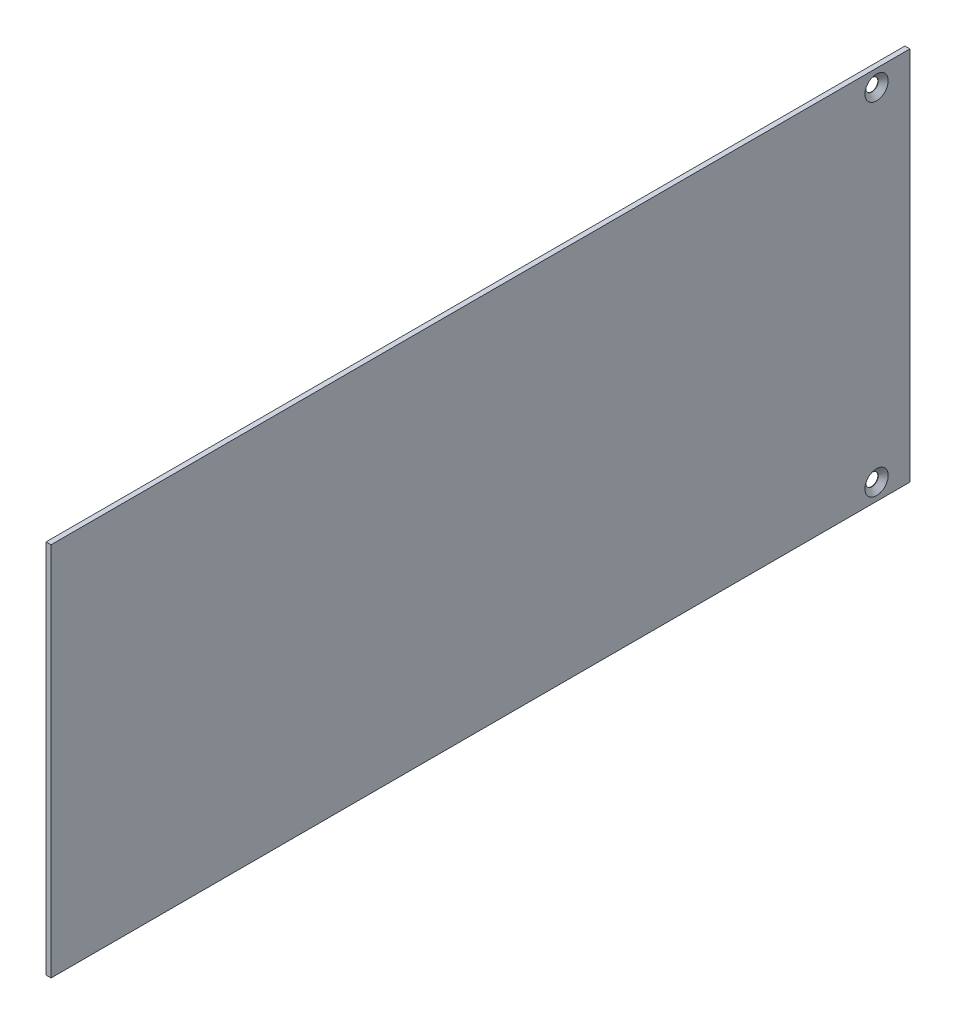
ISO-10303-21;
HEADER;
FILE_DESCRIPTION(('STEP AP214'),'2;1');
FILE_NAME('part.step','',(''),(''),'','','');
FILE_SCHEMA(('AUTOMOTIVE_DESIGN { 1 0 10303 214 1 1 1 1 }'));
ENDSEC;
DATA;
#1=APPLICATION_CONTEXT('core data for automotive mechanical design processes');
#2=APPLICATION_PROTOCOL_DEFINITION('international standard','automotive_design',2000,#1);
#3=PRODUCT_CONTEXT('',#1,'mechanical');
#4=PRODUCT('Part','Part','',(#3));
#5=PRODUCT_RELATED_PRODUCT_CATEGORY('part','',(#4));
#6=PRODUCT_DEFINITION_FORMATION('','',#4);
#7=PRODUCT_DEFINITION_CONTEXT('part definition',#1,'design');
#8=PRODUCT_DEFINITION('design','',#6,#7);
#9=PRODUCT_DEFINITION_SHAPE('','',#8);
#10=(LENGTH_UNIT() NAMED_UNIT(*) SI_UNIT(.MILLI.,.METRE.));
#11=(NAMED_UNIT(*) PLANE_ANGLE_UNIT() SI_UNIT($,.RADIAN.));
#12=(NAMED_UNIT(*) SI_UNIT($,.STERADIAN.) SOLID_ANGLE_UNIT());
#13=UNCERTAINTY_MEASURE_WITH_UNIT(LENGTH_MEASURE(1.E-05),#10,'distance_accuracy_value','');
#14=(GEOMETRIC_REPRESENTATION_CONTEXT(3) GLOBAL_UNCERTAINTY_ASSIGNED_CONTEXT((#13)) GLOBAL_UNIT_ASSIGNED_CONTEXT((#10,
#11,#12)) REPRESENTATION_CONTEXT('',''));
#15=CARTESIAN_POINT('',(0.,0.,0.));
#16=DIRECTION('',(0.,0.,1.));
#17=DIRECTION('',(1.,0.,0.));
#18=AXIS2_PLACEMENT_3D('',#15,#16,#17);
#19=CARTESIAN_POINT('',(-1.524,57.15,130.81));
#20=DIRECTION('',(1.,0.,0.));
#21=DIRECTION('',(0.,1.,0.));
#22=AXIS2_PLACEMENT_3D('',#19,#20,#21);
#23=PLANE('',#22);
#24=CARTESIAN_POINT('',(-1.524,52.07,-120.65));
#25=DIRECTION('',(1.,0.,0.));
#26=DIRECTION('',(0.,0.,-1.));
#27=AXIS2_PLACEMENT_3D('',#24,#25,#26);
#28=CIRCLE('',#27,1.89865);
#29=CARTESIAN_POINT('',(-1.524,52.07,-122.54865));
#30=VERTEX_POINT('',#29);
#31=EDGE_CURVE('E117',#30,#30,#28,.T.);
#32=ORIENTED_EDGE('',*,*,#31,.T.);
#33=EDGE_LOOP('',(#32));
#34=FACE_BOUND('',#33,.T.);
#35=CARTESIAN_POINT('',(-1.524,-52.07,-120.65));
#36=DIRECTION('',(1.,0.,0.));
#37=DIRECTION('',(0.,0.,-1.));
#38=AXIS2_PLACEMENT_3D('',#35,#36,#37);
#39=CIRCLE('',#38,1.89865);
#40=CARTESIAN_POINT('',(-1.524,-52.07,-122.54865));
#41=VERTEX_POINT('',#40);
#42=EDGE_CURVE('E98',#41,#41,#39,.T.);
#43=ORIENTED_EDGE('',*,*,#42,.T.);
#44=EDGE_LOOP('',(#43));
#45=FACE_BOUND('',#44,.T.);
#46=DIRECTION('',(0.,-1.,0.));
#47=VECTOR('',#46,1.);
#48=CARTESIAN_POINT('',(-1.524,57.15,-130.81));
#49=LINE('',#48,#47);
#50=CARTESIAN_POINT('',(-1.524,57.15,-130.81));
#51=VERTEX_POINT('',#50);
#52=CARTESIAN_POINT('',(-1.524,-57.15,-130.81));
#53=VERTEX_POINT('',#52);
#54=EDGE_CURVE('E95',#51,#53,#49,.T.);
#55=ORIENTED_EDGE('',*,*,#54,.T.);
#56=DIRECTION('',(0.,0.,-1.));
#57=VECTOR('',#56,1.);
#58=CARTESIAN_POINT('',(-1.524,-57.15,130.81));
#59=LINE('',#58,#57);
#60=CARTESIAN_POINT('',(-1.524,-57.15,130.81));
#61=VERTEX_POINT('',#60);
#62=EDGE_CURVE('E11',#61,#53,#59,.T.);
#63=ORIENTED_EDGE('',*,*,#62,.F.);
#64=DIRECTION('',(0.,-1.,0.));
#65=VECTOR('',#64,1.);
#66=CARTESIAN_POINT('',(-1.524,57.15,130.81));
#67=LINE('',#66,#65);
#68=CARTESIAN_POINT('',(-1.524,57.15,130.81));
#69=VERTEX_POINT('',#68);
#70=EDGE_CURVE('E83',#69,#61,#67,.T.);
#71=ORIENTED_EDGE('',*,*,#70,.F.);
#72=DIRECTION('',(0.,0.,-1.));
#73=VECTOR('',#72,1.);
#74=CARTESIAN_POINT('',(-1.524,57.15,130.81));
#75=LINE('',#74,#73);
#76=EDGE_CURVE('E91',#69,#51,#75,.T.);
#77=ORIENTED_EDGE('',*,*,#76,.T.);
#78=EDGE_LOOP('',(#55,#63,#71,#77));
#79=FACE_BOUND('',#78,.T.);
#80=ADVANCED_FACE('F32',(#34,#45,#79),#23,.F.);
#81=CARTESIAN_POINT('',(-1.524,-57.15,130.81));
#82=DIRECTION('',(0.,1.,0.));
#83=DIRECTION('',(-1.,0.,0.));
#84=AXIS2_PLACEMENT_3D('',#81,#82,#83);
#85=PLANE('',#84);
#86=DIRECTION('',(1.,0.,0.));
#87=VECTOR('',#86,1.);
#88=CARTESIAN_POINT('',(-1.524,-57.15,-130.81));
#89=LINE('',#88,#87);
#90=CARTESIAN_POINT('',(0.,-57.15,-130.81));
#91=VERTEX_POINT('',#90);
#92=EDGE_CURVE('E87',#53,#91,#89,.T.);
#93=ORIENTED_EDGE('',*,*,#92,.T.);
#94=DIRECTION('',(0.,0.,-1.));
#95=VECTOR('',#94,1.);
#96=CARTESIAN_POINT('',(0.,-57.15,130.81));
#97=LINE('',#96,#95);
#98=CARTESIAN_POINT('',(0.,-57.15,130.81));
#99=VERTEX_POINT('',#98);
#100=EDGE_CURVE('E40',#99,#91,#97,.T.);
#101=ORIENTED_EDGE('',*,*,#100,.F.);
#102=DIRECTION('',(1.,0.,0.));
#103=VECTOR('',#102,1.);
#104=CARTESIAN_POINT('',(-1.524,-57.15,130.81));
#105=LINE('',#104,#103);
#106=EDGE_CURVE('E78',#61,#99,#105,.T.);
#107=ORIENTED_EDGE('',*,*,#106,.F.);
#108=ORIENTED_EDGE('',*,*,#62,.T.);
#109=EDGE_LOOP('',(#93,#101,#107,#108));
#110=FACE_BOUND('',#109,.T.);
#111=ADVANCED_FACE('F86',(#110),#85,.F.);
#112=CARTESIAN_POINT('',(0.,57.15,130.81));
#113=DIRECTION('',(-1.,0.,0.));
#114=DIRECTION('',(0.,0.,1.));
#115=AXIS2_PLACEMENT_3D('',#112,#113,#114);
#116=PLANE('',#115);
#117=CARTESIAN_POINT('',(0.,52.07,-120.65));
#118=DIRECTION('',(1.,0.,0.));
#119=DIRECTION('',(0.,0.,-1.));
#120=AXIS2_PLACEMENT_3D('',#117,#118,#119);
#121=CIRCLE('',#120,3.543305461);
#122=CARTESIAN_POINT('',(0.,52.07,-124.193305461));
#123=VERTEX_POINT('',#122);
#124=EDGE_CURVE('E123',#123,#123,#121,.T.);
#125=ORIENTED_EDGE('',*,*,#124,.F.);
#126=EDGE_LOOP('',(#125));
#127=FACE_BOUND('',#126,.T.);
#128=CARTESIAN_POINT('',(0.,-52.07,-120.65));
#129=DIRECTION('',(1.,0.,0.));
#130=DIRECTION('',(0.,0.,-1.));
#131=AXIS2_PLACEMENT_3D('',#128,#129,#130);
#132=CIRCLE('',#131,3.543305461);
#133=CARTESIAN_POINT('',(0.,-52.07,-124.193305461));
#134=VERTEX_POINT('',#133);
#135=EDGE_CURVE('E114',#134,#134,#132,.T.);
#136=ORIENTED_EDGE('',*,*,#135,.F.);
#137=EDGE_LOOP('',(#136));
#138=FACE_BOUND('',#137,.T.);
#139=DIRECTION('',(0.,1.,0.));
#140=VECTOR('',#139,1.);
#141=CARTESIAN_POINT('',(0.,57.15,-130.81));
#142=LINE('',#141,#140);
#143=CARTESIAN_POINT('',(0.,57.15,-130.81));
#144=VERTEX_POINT('',#143);
#145=EDGE_CURVE('E65',#91,#144,#142,.T.);
#146=ORIENTED_EDGE('',*,*,#145,.T.);
#147=DIRECTION('',(0.,0.,-1.));
#148=VECTOR('',#147,1.);
#149=CARTESIAN_POINT('',(0.,57.15,130.81));
#150=LINE('',#149,#148);
#151=CARTESIAN_POINT('',(0.,57.15,130.81));
#152=VERTEX_POINT('',#151);
#153=EDGE_CURVE('E88',#152,#144,#150,.T.);
#154=ORIENTED_EDGE('',*,*,#153,.F.);
#155=DIRECTION('',(0.,1.,0.));
#156=VECTOR('',#155,1.);
#157=CARTESIAN_POINT('',(0.,57.15,130.81));
#158=LINE('',#157,#156);
#159=EDGE_CURVE('E81',#99,#152,#158,.T.);
#160=ORIENTED_EDGE('',*,*,#159,.F.);
#161=ORIENTED_EDGE('',*,*,#100,.T.);
#162=EDGE_LOOP('',(#146,#154,#160,#161));
#163=FACE_BOUND('',#162,.T.);
#164=ADVANCED_FACE('F89',(#127,#138,#163),#116,.F.);
#165=CARTESIAN_POINT('',(-1.524,57.15,130.81));
#166=DIRECTION('',(0.,-1.,0.));
#167=DIRECTION('',(0.,0.,-1.));
#168=AXIS2_PLACEMENT_3D('',#165,#166,#167);
#169=PLANE('',#168);
#170=DIRECTION('',(-1.,0.,0.));
#171=VECTOR('',#170,1.);
#172=CARTESIAN_POINT('',(-1.524,57.15,-130.81));
#173=LINE('',#172,#171);
#174=EDGE_CURVE('E71',#144,#51,#173,.T.);
#175=ORIENTED_EDGE('',*,*,#174,.T.);
#176=ORIENTED_EDGE('',*,*,#76,.F.);
#177=DIRECTION('',(-1.,0.,0.));
#178=VECTOR('',#177,1.);
#179=CARTESIAN_POINT('',(-1.524,57.15,130.81));
#180=LINE('',#179,#178);
#181=EDGE_CURVE('E48',#152,#69,#180,.T.);
#182=ORIENTED_EDGE('',*,*,#181,.F.);
#183=ORIENTED_EDGE('',*,*,#153,.T.);
#184=EDGE_LOOP('',(#175,#176,#182,#183));
#185=FACE_BOUND('',#184,.T.);
#186=ADVANCED_FACE('F103',(#185),#169,.F.);
#187=CARTESIAN_POINT('',(-1.524,-57.15,130.81));
#188=DIRECTION('',(0.,0.,1.));
#189=DIRECTION('',(1.,0.,0.));
#190=AXIS2_PLACEMENT_3D('',#187,#188,#189);
#191=PLANE('',#190);
#192=ORIENTED_EDGE('',*,*,#70,.T.);
#193=ORIENTED_EDGE('',*,*,#106,.T.);
#194=ORIENTED_EDGE('',*,*,#159,.T.);
#195=ORIENTED_EDGE('',*,*,#181,.T.);
#196=EDGE_LOOP('',(#192,#193,#194,#195));
#197=FACE_BOUND('',#196,.T.);
#198=ADVANCED_FACE('F79',(#197),#191,.T.);
#199=CARTESIAN_POINT('',(-1.524,-57.15,-130.81));
#200=DIRECTION('',(0.,0.,1.));
#201=DIRECTION('',(1.,0.,0.));
#202=AXIS2_PLACEMENT_3D('',#199,#200,#201);
#203=PLANE('',#202);
#204=ORIENTED_EDGE('',*,*,#54,.F.);
#205=ORIENTED_EDGE('',*,*,#174,.F.);
#206=ORIENTED_EDGE('',*,*,#145,.F.);
#207=ORIENTED_EDGE('',*,*,#92,.F.);
#208=EDGE_LOOP('',(#204,#205,#206,#207));
#209=FACE_BOUND('',#208,.T.);
#210=ADVANCED_FACE('F106',(#209),#203,.F.);
#211=CARTESIAN_POINT('',(0.,-52.07,-120.65));
#212=DIRECTION('',(1.,0.,0.));
#213=DIRECTION('',(0.,0.,-1.));
#214=AXIS2_PLACEMENT_3D('',#211,#212,#213);
#215=CYLINDRICAL_SURFACE('',#214,1.89865);
#216=ORIENTED_EDGE('',*,*,#42,.F.);
#217=EDGE_LOOP('',(#216));
#218=FACE_BOUND('',#217,.T.);
#219=CARTESIAN_POINT('',(-1.3800297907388,-52.07,-120.65));
#220=DIRECTION('',(1.,0.,0.));
#221=DIRECTION('',(0.,0.,-1.));
#222=AXIS2_PLACEMENT_3D('',#219,#220,#221);
#223=CIRCLE('',#222,1.89865);
#224=CARTESIAN_POINT('',(-1.3800297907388,-52.07,-122.54865));
#225=VERTEX_POINT('',#224);
#226=EDGE_CURVE('E111',#225,#225,#223,.T.);
#227=ORIENTED_EDGE('',*,*,#226,.T.);
#228=EDGE_LOOP('',(#227));
#229=FACE_BOUND('',#228,.T.);
#230=ADVANCED_FACE('F137',(#218,#229),#215,.F.);
#231=CARTESIAN_POINT('',(0.,-52.07,-120.65));
#232=DIRECTION('',(1.,0.,0.));
#233=DIRECTION('',(0.,0.,-1.));
#234=AXIS2_PLACEMENT_3D('',#231,#232,#233);
#235=CONICAL_SURFACE('',#234,3.543305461,0.872664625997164);
#236=ORIENTED_EDGE('',*,*,#226,.F.);
#237=EDGE_LOOP('',(#236));
#238=FACE_BOUND('',#237,.T.);
#239=ORIENTED_EDGE('',*,*,#135,.T.);
#240=EDGE_LOOP('',(#239));
#241=FACE_BOUND('',#240,.T.);
#242=ADVANCED_FACE('F134',(#238,#241),#235,.F.);
#243=CARTESIAN_POINT('',(0.,52.07,-120.65));
#244=DIRECTION('',(1.,0.,0.));
#245=DIRECTION('',(0.,0.,-1.));
#246=AXIS2_PLACEMENT_3D('',#243,#244,#245);
#247=CYLINDRICAL_SURFACE('',#246,1.89865);
#248=ORIENTED_EDGE('',*,*,#31,.F.);
#249=EDGE_LOOP('',(#248));
#250=FACE_BOUND('',#249,.T.);
#251=CARTESIAN_POINT('',(-1.3800297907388,52.07,-120.65));
#252=DIRECTION('',(1.,0.,0.));
#253=DIRECTION('',(0.,0.,-1.));
#254=AXIS2_PLACEMENT_3D('',#251,#252,#253);
#255=CIRCLE('',#254,1.89865);
#256=CARTESIAN_POINT('',(-1.3800297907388,52.07,-122.54865));
#257=VERTEX_POINT('',#256);
#258=EDGE_CURVE('E120',#257,#257,#255,.T.);
#259=ORIENTED_EDGE('',*,*,#258,.T.);
#260=EDGE_LOOP('',(#259));
#261=FACE_BOUND('',#260,.T.);
#262=ADVANCED_FACE('F136',(#250,#261),#247,.F.);
#263=CARTESIAN_POINT('',(0.,52.07,-120.65));
#264=DIRECTION('',(1.,0.,0.));
#265=DIRECTION('',(0.,0.,-1.));
#266=AXIS2_PLACEMENT_3D('',#263,#264,#265);
#267=CONICAL_SURFACE('',#266,3.543305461,0.872664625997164);
#268=ORIENTED_EDGE('',*,*,#258,.F.);
#269=EDGE_LOOP('',(#268));
#270=FACE_BOUND('',#269,.T.);
#271=ORIENTED_EDGE('',*,*,#124,.T.);
#272=EDGE_LOOP('',(#271));
#273=FACE_BOUND('',#272,.T.);
#274=ADVANCED_FACE('F127',(#270,#273),#267,.F.);
#275=CLOSED_SHELL('',(#80,#111,#164,#186,#198,#210,#230,#242,#262,#274));
#276=MANIFOLD_SOLID_BREP('B2',#275);
#277=ADVANCED_BREP_SHAPE_REPRESENTATION('',(#18,#276),#14);
#278=SHAPE_DEFINITION_REPRESENTATION(#9,#277);
ENDSEC;
END-ISO-10303-21;
